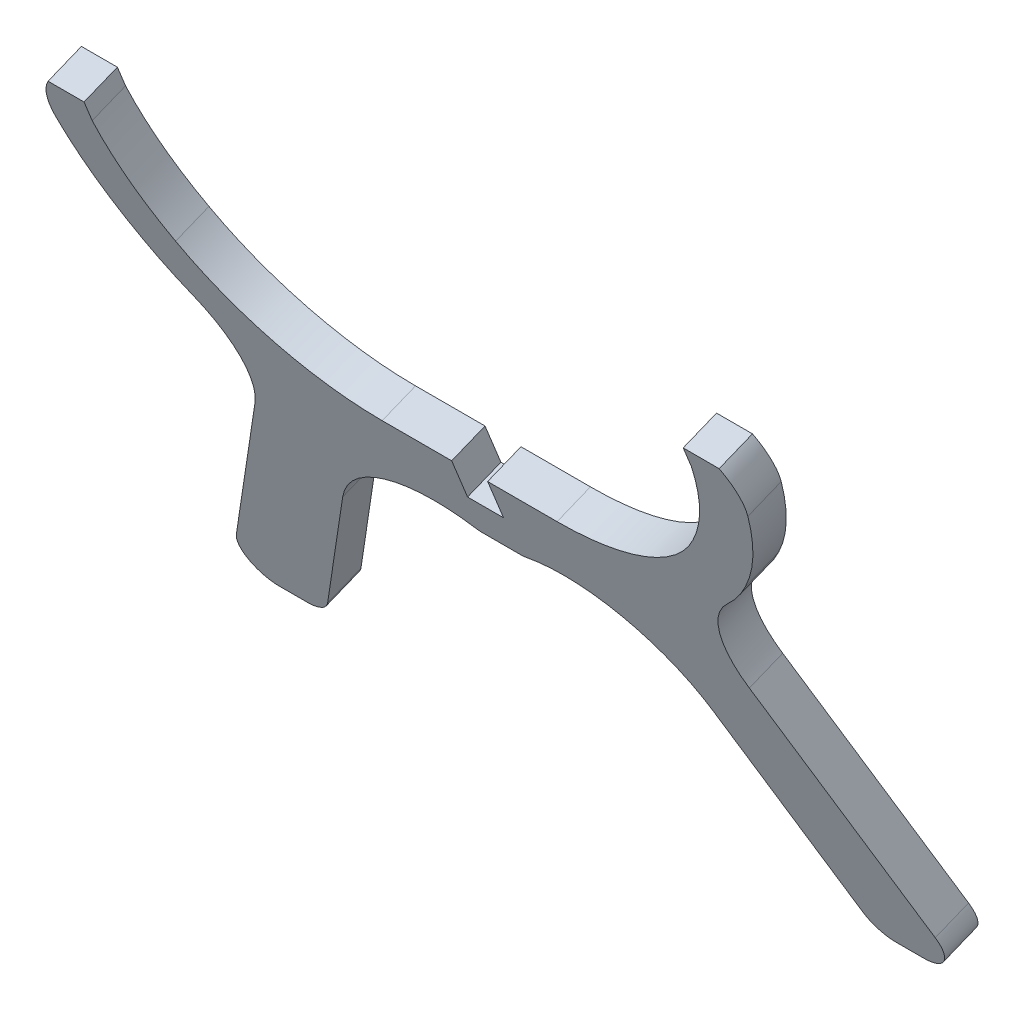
from build123d import *

# Parameters (mm, degrees)
EXTRUDE_1_DEPTH = 18


with BuildPart() as part:
    # Sketch 1 → Extrude 1 (new, symmetric)
    with BuildSketch(Plane(origin=(0, 0, 0), x_dir=(-1, 0, 0), z_dir=(0, 0.37460659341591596, -0.9271838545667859))):
        with BuildLine():
            Line((-300, -241.880845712), (-300, -220))
            Line((-300, -220), (-336, -220))
            ThreePointArc((-336, -220), (-346.11350268, -243.403905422), (-346.442498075, -268.897384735))
            ThreePointArc((-346.442498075, -268.897384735), (-329.350896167, -327.897552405), (-301.164181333, -382.474578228))
            ThreePointArc((-301.164181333, -382.474578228), (-285.390886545, -404.637058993), (-267.327943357, -424.976736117))
            ThreePointArc((-267.327943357, -424.976736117), (-239.948543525, -477.882827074), (-247.513299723, -536.971408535))
            Line((-247.513299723, -536.971408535), (-349.946217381, -760.453650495))
            ThreePointArc((-349.946217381, -760.453650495), (-347.923199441, -789.155502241), (-322.674437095, -802.953650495))
            Line((-322.674437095, -802.953650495), (-295.173482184, -802.953650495))
            ThreePointArc((-295.173482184, -802.953650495), (-278.971630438, -798.202412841), (-267.901701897, -785.453650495))
            Line((-267.901701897, -785.453650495), (-185.470632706, -605.610289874))
            ThreePointArc((-185.470632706, -605.610289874), (-118.863978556, -539.658241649), (-25.294649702, -534.099488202))
            ThreePointArc((-25.294649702, -534.099488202), (-22.361738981, -534.773590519), (-19.360886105, -535))
            Line((-19.360886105, -535), (19.360886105, -535))
            ThreePointArc((19.360886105, -535), (22.361738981, -534.773590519), (25.294649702, -534.099488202))
            ThreePointArc((25.294649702, -534.099488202), (118.863978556, -539.658241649), (185.470632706, -605.610289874))
            Line((185.470632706, -605.610289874), (267.901701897, -785.453650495))
            ThreePointArc((267.901701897, -785.453650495), (278.971630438, -798.202412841), (295.173482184, -802.953650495))
            Line((295.173482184, -802.953650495), (322.674437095, -802.953650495))
            ThreePointArc((322.674437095, -802.953650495), (347.923199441, -789.155502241), (349.946217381, -760.453650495))
            Line((349.946217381, -760.453650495), (247.513299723, -536.971408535))
            ThreePointArc((247.513299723, -536.971408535), (239.948543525, -477.882827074), (267.327943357, -424.976736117))
            ThreePointArc((267.327943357, -424.976736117), (285.390886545, -404.637058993), (301.164181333, -382.474578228))
            ThreePointArc((301.164181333, -382.474578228), (329.350896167, -327.897552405), (346.442498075, -268.897384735))
            ThreePointArc((346.442498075, -268.897384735), (346.11350268, -243.403905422), (336, -220))
            Line((336, -220), (300, -220))
            Line((300, -220), (300, -241.880845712))
            ThreePointArc((300, -241.880845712), (286.064085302, -301.056313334), (259.051263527, -355.51963261))
            ThreePointArc((259.051263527, -355.51963261), (185.468491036, -424.816615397), (87.579301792, -450))
            Line((87.579301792, -450), (18, -450))
            Line((18, -450), (18, -492.5))
            Line((18, -492.5), (-18, -492.5))
            Line((-18, -492.5), (-18, -450))
            Line((-18, -450), (-87.579301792, -450))
            ThreePointArc((-87.579301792, -450), (-185.468491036, -424.816615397), (-259.051263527, -355.51963261))
            ThreePointArc((-259.051263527, -355.51963261), (-286.064085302, -301.056313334), (-300, -241.880845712))
        make_face()
    extrude(amount=EXTRUDE_1_DEPTH, both=True)


solid = part.part
